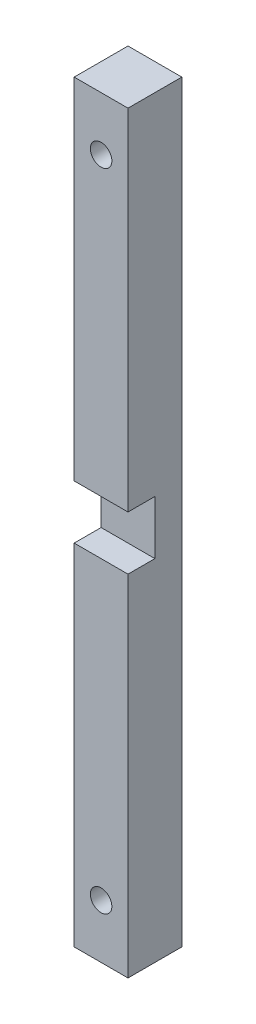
from build123d import *

# Parameters (mm, degrees)
SKETCH1_W           = 10
SKETCH1_H           = 140
BOSS_EXTRUDE1_DEPTH = 10
SKETCH5_R           = 2
CUT_EXTRUDE1_DEPTH  = 20
SKETCH6_W           = 10
SKETCH6_H           = 10
CUT_EXTRUDE2_DEPTH  = 5


with BuildPart() as part:
    # Sketch1 → Boss-Extrude1 (new body)
    with BuildSketch(Plane.XY):
        with Locations((5, -70)):
            Rectangle(SKETCH1_W, SKETCH1_H)
    extrude(amount=BOSS_EXTRUDE1_DEPTH)

    # Sketch5 → Cut-Extrude1 (cut)
    with BuildSketch(Plane.XY.offset(10)):
        with Locations((5, -10)):
            Circle(SKETCH5_R)
        with Locations((5, -130)):
            Circle(SKETCH5_R)
    extrude(amount=-CUT_EXTRUDE1_DEPTH, mode=Mode.SUBTRACT)

    # Sketch6 → Cut-Extrude2 (cut)
    with BuildSketch(Plane.XY.offset(10)):
        with Locations((5, -70)):
            Rectangle(SKETCH6_W, SKETCH6_H)
    extrude(amount=-CUT_EXTRUDE2_DEPTH, mode=Mode.SUBTRACT)


solid = part.part
